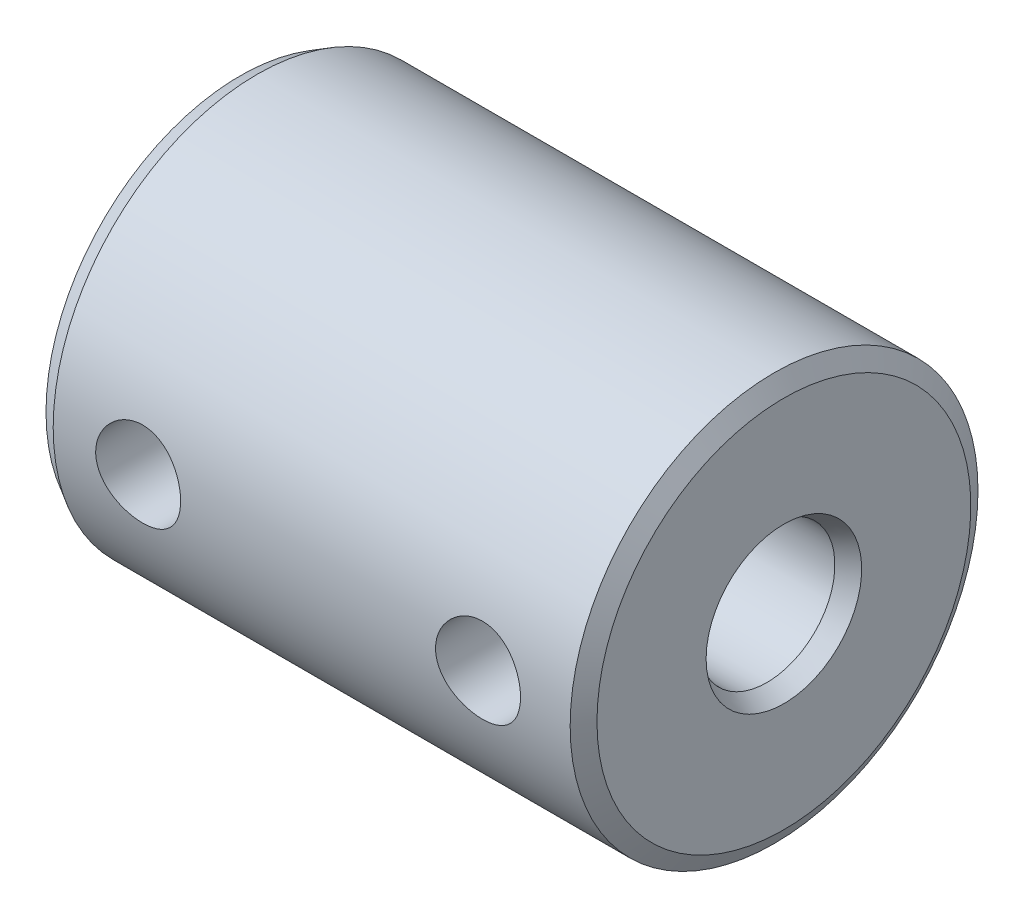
ISO-10303-21;
HEADER;
FILE_DESCRIPTION(('STEP AP214'),'2;1');
FILE_NAME('part.step','',(''),(''),'','','');
FILE_SCHEMA(('AUTOMOTIVE_DESIGN { 1 0 10303 214 1 1 1 1 }'));
ENDSEC;
DATA;
#1=APPLICATION_CONTEXT('core data for automotive mechanical design processes');
#2=APPLICATION_PROTOCOL_DEFINITION('international standard','automotive_design',2000,#1);
#3=PRODUCT_CONTEXT('',#1,'mechanical');
#4=PRODUCT('Part','Part','',(#3));
#5=PRODUCT_RELATED_PRODUCT_CATEGORY('part','',(#4));
#6=PRODUCT_DEFINITION_FORMATION('','',#4);
#7=PRODUCT_DEFINITION_CONTEXT('part definition',#1,'design');
#8=PRODUCT_DEFINITION('design','',#6,#7);
#9=PRODUCT_DEFINITION_SHAPE('','',#8);
#10=(LENGTH_UNIT() NAMED_UNIT(*) SI_UNIT(.MILLI.,.METRE.));
#11=(NAMED_UNIT(*) PLANE_ANGLE_UNIT() SI_UNIT($,.RADIAN.));
#12=(NAMED_UNIT(*) SI_UNIT($,.STERADIAN.) SOLID_ANGLE_UNIT());
#13=UNCERTAINTY_MEASURE_WITH_UNIT(LENGTH_MEASURE(1.E-05),#10,'distance_accuracy_value','');
#14=(GEOMETRIC_REPRESENTATION_CONTEXT(3) GLOBAL_UNCERTAINTY_ASSIGNED_CONTEXT((#13)) GLOBAL_UNIT_ASSIGNED_CONTEXT((#10,
#11,#12)) REPRESENTATION_CONTEXT('',''));
#15=CARTESIAN_POINT('',(0.,0.,0.));
#16=DIRECTION('',(0.,0.,1.));
#17=DIRECTION('',(1.,0.,0.));
#18=AXIS2_PLACEMENT_3D('',#15,#16,#17);
#19=CARTESIAN_POINT('',(0.,0.,0.));
#20=DIRECTION('',(-1.,0.,0.));
#21=DIRECTION('',(0.,0.,1.));
#22=AXIS2_PLACEMENT_3D('',#19,#20,#21);
#23=CYLINDRICAL_SURFACE('',#22,3.);
#24=CARTESIAN_POINT('',(4.24999999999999,0.,3.));
#25=CARTESIAN_POINT('',(4.2499927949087,0.0669580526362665,2.99999458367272));
#26=CARTESIAN_POINT('',(4.24458804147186,0.13402139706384,2.9977323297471));
#27=CARTESIAN_POINT('',(4.22316093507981,0.266247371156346,2.98890153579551));
#28=CARTESIAN_POINT('',(4.20711087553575,0.331404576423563,2.98232175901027));
#29=CARTESIAN_POINT('',(4.16508890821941,0.457688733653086,2.96556289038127));
#30=CARTESIAN_POINT('',(4.13915061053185,0.518828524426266,2.95539599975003));
#31=CARTESIAN_POINT('',(4.07822717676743,0.635829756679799,2.93245286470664));
#32=CARTESIAN_POINT('',(4.04324478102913,0.691692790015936,2.91967741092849));
#33=CARTESIAN_POINT('',(3.96337101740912,0.799448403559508,2.89207828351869));
#34=CARTESIAN_POINT('',(3.91809869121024,0.851041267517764,2.87718753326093));
#35=CARTESIAN_POINT('',(3.81973566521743,0.946159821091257,2.84732714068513));
#36=CARTESIAN_POINT('',(3.76664087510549,0.98968126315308,2.83235746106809));
#37=CARTESIAN_POINT('',(3.6509732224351,1.06953737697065,2.80321021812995));
#38=CARTESIAN_POINT('',(3.58806255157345,1.10541308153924,2.78910786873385));
#39=CARTESIAN_POINT('',(3.45642674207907,1.16593940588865,2.76435572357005));
#40=CARTESIAN_POINT('',(3.38770462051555,1.1905958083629,2.75370415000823));
#41=CARTESIAN_POINT('',(3.24984630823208,1.22674598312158,2.73778555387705));
#42=CARTESIAN_POINT('',(3.18088951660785,1.23881657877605,2.73228387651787));
#43=CARTESIAN_POINT('',(3.04172670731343,1.25125209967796,2.72661326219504));
#44=CARTESIAN_POINT('',(2.97152139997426,1.25162348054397,2.7264413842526));
#45=CARTESIAN_POINT('',(2.83759993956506,1.24108450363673,2.73125119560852));
#46=CARTESIAN_POINT('',(2.77379890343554,1.231036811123,2.73583882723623));
#47=CARTESIAN_POINT('',(2.64888790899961,1.20139191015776,2.74898482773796));
#48=CARTESIAN_POINT('',(2.58777846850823,1.18179287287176,2.75754395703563));
#49=CARTESIAN_POINT('',(2.46844229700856,1.1332195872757,2.77786184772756));
#50=CARTESIAN_POINT('',(2.41030457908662,1.10405471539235,2.78968481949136));
#51=CARTESIAN_POINT('',(2.29952226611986,1.03731242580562,2.81518331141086));
#52=CARTESIAN_POINT('',(2.24687984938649,0.999731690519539,2.82885956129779));
#53=CARTESIAN_POINT('',(2.14390004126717,0.913495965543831,2.85792976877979));
#54=CARTESIAN_POINT('',(2.09413343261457,0.864173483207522,2.87337121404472));
#55=CARTESIAN_POINT('',(2.00338649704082,0.757729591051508,2.90325673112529));
#56=CARTESIAN_POINT('',(1.96240822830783,0.700606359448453,2.9177005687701));
#57=CARTESIAN_POINT('',(1.88956417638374,0.578447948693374,2.94438283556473));
#58=CARTESIAN_POINT('',(1.85793055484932,0.513260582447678,2.95656266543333));
#59=CARTESIAN_POINT('',(1.80627886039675,0.37785240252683,2.97689481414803));
#60=CARTESIAN_POINT('',(1.78625436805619,0.307634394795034,2.985049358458));
#61=CARTESIAN_POINT('',(1.75958400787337,0.168928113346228,2.99599641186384));
#62=CARTESIAN_POINT('',(1.75217214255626,0.100611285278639,2.99909541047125));
#63=CARTESIAN_POINT('',(1.74865377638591,-0.0363546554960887,3.00056050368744));
#64=CARTESIAN_POINT('',(1.75254402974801,-0.105003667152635,2.99892795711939));
#65=CARTESIAN_POINT('',(1.77097108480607,-0.237098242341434,2.9913121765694));
#66=CARTESIAN_POINT('',(1.7849699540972,-0.300632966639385,2.98554887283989));
#67=CARTESIAN_POINT('',(1.82246819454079,-0.424382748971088,2.97048606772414));
#68=CARTESIAN_POINT('',(1.84596876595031,-0.484597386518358,2.96118611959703));
#69=CARTESIAN_POINT('',(1.90257097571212,-0.602108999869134,2.93958270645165));
#70=CARTESIAN_POINT('',(1.93594818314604,-0.659257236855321,2.92719491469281));
#71=CARTESIAN_POINT('',(2.0110533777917,-0.767346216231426,2.9007380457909));
#72=CARTESIAN_POINT('',(2.05278485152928,-0.818284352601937,2.88666826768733));
#73=CARTESIAN_POINT('',(2.14690323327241,-0.91633343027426,2.85712087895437));
#74=CARTESIAN_POINT('',(2.19983850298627,-0.962910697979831,2.84161451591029));
#75=CARTESIAN_POINT('',(2.3130212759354,-1.0466698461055,2.81184336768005));
#76=CARTESIAN_POINT('',(2.37327043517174,-1.08384959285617,2.79757886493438));
#77=CARTESIAN_POINT('',(2.50061417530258,-1.14815960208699,2.77181386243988));
#78=CARTESIAN_POINT('',(2.56779403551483,-1.17513918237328,2.76035562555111));
#79=CARTESIAN_POINT('',(2.70637059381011,-1.21717413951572,2.74208355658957));
#80=CARTESIAN_POINT('',(2.77776376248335,-1.23223934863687,2.73526589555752));
#81=CARTESIAN_POINT('',(2.91681869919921,-1.249040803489,2.72763164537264));
#82=CARTESIAN_POINT('',(2.98434466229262,-1.25171380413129,2.72639350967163));
#83=CARTESIAN_POINT('',(3.1188428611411,-1.24615575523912,2.72893853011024));
#84=CARTESIAN_POINT('',(3.18581518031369,-1.23792637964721,2.73272091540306));
#85=CARTESIAN_POINT('',(3.31409274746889,-1.21158404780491,2.74449551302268));
#86=CARTESIAN_POINT('',(3.37551667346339,-1.19394903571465,2.7522835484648));
#87=CARTESIAN_POINT('',(3.49454802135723,-1.14976328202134,2.77103181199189));
#88=CARTESIAN_POINT('',(3.55215436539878,-1.12321003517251,2.78199293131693));
#89=CARTESIAN_POINT('',(3.66569589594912,-1.06010285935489,2.80666954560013));
#90=CARTESIAN_POINT('',(3.72132233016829,-1.02304360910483,2.82051102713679));
#91=CARTESIAN_POINT('',(3.82586013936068,-0.940684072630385,2.84903689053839));
#92=CARTESIAN_POINT('',(3.87476917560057,-0.895380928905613,2.86372156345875));
#93=CARTESIAN_POINT('',(3.96814868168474,-0.793902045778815,2.89356392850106));
#94=CARTESIAN_POINT('',(4.01203643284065,-0.737174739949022,2.90867817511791));
#95=CARTESIAN_POINT('',(4.08969945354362,-0.616600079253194,2.9366014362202));
#96=CARTESIAN_POINT('',(4.12347011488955,-0.552749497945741,2.9494093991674));
#97=CARTESIAN_POINT('',(4.17920984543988,-0.420732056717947,2.9710918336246));
#98=CARTESIAN_POINT('',(4.20136476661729,-0.352653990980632,2.98002782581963));
#99=CARTESIAN_POINT('',(4.23370632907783,-0.213410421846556,2.99321009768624));
#100=CARTESIAN_POINT('',(4.24393044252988,-0.142255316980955,2.99747105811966));
#101=CARTESIAN_POINT('',(4.24933316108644,-0.047236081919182,2.99972287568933));
#102=CARTESIAN_POINT('',(4.25000254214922,-0.0236245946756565,3.00000191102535));
#103=CARTESIAN_POINT('',(4.24999999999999,0.,3.));
#104=B_SPLINE_CURVE_WITH_KNOTS('',3,(#24,#25,#26,#27,#28,#29,#30,#31,#32,#33,#34,#35,#36,#37,
#38,#39,#40,#41,#42,#43,#44,#45,#46,#47,#48,#49,#50,#51,#52,#53,#54,#55,#56,#57,#58,#59,#60,#61,
#62,#63,#64,#65,#66,#67,#68,#69,#70,#71,#72,#73,#74,#75,#76,#77,#78,#79,#80,#81,#82,#83,#84,#85,
#86,#87,#88,#89,#90,#91,#92,#93,#94,#95,#96,#97,#98,#99,#100,#101,#102,#103),.UNSPECIFIED.,.T.,
.F.,(4,2,2,2,2,2,2,2,2,2,2,2,2,2,2,2,2,2,2,2,2,2,2,2,2,2,2,2,2,2,2,2,2,2,2,2,2,2,2,4),(0.,
0.200806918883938,0.402138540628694,0.602791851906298,0.80338443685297,1.01317936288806,
1.22308438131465,1.44331724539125,1.66343646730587,1.87295273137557,2.08235338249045,
2.27570157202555,2.46908679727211,2.66658713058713,2.86416545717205,3.07844141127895,
3.29276749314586,3.51204055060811,3.73119224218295,3.93648443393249,4.1417176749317,
4.33676589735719,4.53183876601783,4.73297135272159,4.93418805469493,5.14978488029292,
5.36543061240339,5.58414788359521,5.80268447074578,6.00439877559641,6.20608211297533,
6.3983764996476,6.59072494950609,6.79463893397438,6.99862373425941,7.21746535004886,
7.43640649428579,7.65172855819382,7.86637250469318,7.93722256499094),.UNSPECIFIED.);
#105=CARTESIAN_POINT('',(4.24999999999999,0.,3.));
#106=VERTEX_POINT('',#105);
#107=EDGE_CURVE('E77',#106,#106,#104,.T.);
#108=ORIENTED_EDGE('',*,*,#107,.T.);
#109=EDGE_LOOP('',(#108));
#110=FACE_BOUND('',#109,.T.);
#111=CARTESIAN_POINT('',(0.288675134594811,0.,0.));
#112=DIRECTION('',(1.,0.,0.));
#113=DIRECTION('',(0.,0.,-1.));
#114=AXIS2_PLACEMENT_3D('',#111,#112,#113);
#115=CIRCLE('',#114,3.);
#116=CARTESIAN_POINT('',(0.288675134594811,0.,-3.));
#117=VERTEX_POINT('',#116);
#118=EDGE_CURVE('E109',#117,#117,#115,.F.);
#119=ORIENTED_EDGE('',*,*,#118,.T.);
#120=EDGE_LOOP('',(#119));
#121=FACE_BOUND('',#120,.T.);
#122=CARTESIAN_POINT('',(8.,0.,0.));
#123=DIRECTION('',(-1.,0.,0.));
#124=DIRECTION('',(0.,0.,1.));
#125=AXIS2_PLACEMENT_3D('',#122,#123,#124);
#126=CIRCLE('',#125,3.);
#127=CARTESIAN_POINT('',(8.,0.,3.));
#128=VERTEX_POINT('',#127);
#129=EDGE_CURVE('E76',#128,#128,#126,.T.);
#130=ORIENTED_EDGE('',*,*,#129,.F.);
#131=EDGE_LOOP('',(#130));
#132=FACE_BOUND('',#131,.T.);
#133=ADVANCED_FACE('F30',(#110,#121,#132),#23,.F.);
#134=CARTESIAN_POINT('',(0.,3.,0.));
#135=DIRECTION('',(1.,0.,0.));
#136=DIRECTION('',(0.,0.,-1.));
#137=AXIS2_PLACEMENT_3D('',#134,#135,#136);
#138=PLANE('',#137);
#139=CARTESIAN_POINT('',(0.,0.,0.));
#140=DIRECTION('',(1.,0.,0.));
#141=DIRECTION('',(0.,0.,-1.));
#142=AXIS2_PLACEMENT_3D('',#139,#140,#141);
#143=CIRCLE('',#142,3.5);
#144=CARTESIAN_POINT('',(0.,0.,-3.5));
#145=VERTEX_POINT('',#144);
#146=EDGE_CURVE('E123',#145,#145,#143,.T.);
#147=ORIENTED_EDGE('',*,*,#146,.T.);
#148=EDGE_LOOP('',(#147));
#149=FACE_BOUND('',#148,.T.);
#150=CARTESIAN_POINT('',(0.,0.,0.));
#151=DIRECTION('',(1.,0.,0.));
#152=DIRECTION('',(0.,0.,-1.));
#153=AXIS2_PLACEMENT_3D('',#150,#151,#152);
#154=CIRCLE('',#153,5.71132486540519);
#155=CARTESIAN_POINT('',(0.,0.,-5.71132486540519));
#156=VERTEX_POINT('',#155);
#157=EDGE_CURVE('E117',#156,#156,#154,.F.);
#158=ORIENTED_EDGE('',*,*,#157,.T.);
#159=EDGE_LOOP('',(#158));
#160=FACE_BOUND('',#159,.T.);
#161=ADVANCED_FACE('F94',(#149,#160),#138,.F.);
#162=CARTESIAN_POINT('',(0.,0.,0.));
#163=DIRECTION('',(-1.,0.,0.));
#164=DIRECTION('',(0.,0.,1.));
#165=AXIS2_PLACEMENT_3D('',#162,#163,#164);
#166=CYLINDRICAL_SURFACE('',#165,6.);
#167=CARTESIAN_POINT('',(1.75000000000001,0.,6.));
#168=CARTESIAN_POINT('',(1.75000247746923,0.0694090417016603,5.99999871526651));
#169=CARTESIAN_POINT('',(1.75580066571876,0.138848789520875,5.99878328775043));
#170=CARTESIAN_POINT('',(1.77881934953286,0.275761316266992,5.99405200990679));
#171=CARTESIAN_POINT('',(1.79604852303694,0.343232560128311,5.99053441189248));
#172=CARTESIAN_POINT('',(1.84137045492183,0.474209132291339,5.98159109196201));
#173=CARTESIAN_POINT('',(1.86945239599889,0.537718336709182,5.97616727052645));
#174=CARTESIAN_POINT('',(1.93564960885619,0.659120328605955,5.96399927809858));
#175=CARTESIAN_POINT('',(1.97376443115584,0.717013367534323,5.95725516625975));
#176=CARTESIAN_POINT('',(2.05953634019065,0.826390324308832,5.9430770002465));
#177=CARTESIAN_POINT('',(2.10731200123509,0.87778024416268,5.93563505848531));
#178=CARTESIAN_POINT('',(2.21079465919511,0.971877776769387,5.92095657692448));
#179=CARTESIAN_POINT('',(2.26650231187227,1.01458467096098,5.91372005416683));
#180=CARTESIAN_POINT('',(2.38495196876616,1.09051031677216,5.90019442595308));
#181=CARTESIAN_POINT('',(2.44775838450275,1.1236305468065,5.89391545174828));
#182=CARTESIAN_POINT('',(2.57819745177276,1.17881119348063,5.8831284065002));
#183=CARTESIAN_POINT('',(2.64582958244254,1.20087280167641,5.87862014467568));
#184=CARTESIAN_POINT('',(2.78298523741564,1.23300240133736,5.87196500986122));
#185=CARTESIAN_POINT('',(2.85246835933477,1.24323597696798,5.86978556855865));
#186=CARTESIAN_POINT('',(2.99219684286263,1.25193357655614,5.86793690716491));
#187=CARTESIAN_POINT('',(3.0624421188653,1.25039890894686,5.86826740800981));
#188=CARTESIAN_POINT('',(3.20048102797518,1.23573719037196,5.87137174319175));
#189=CARTESIAN_POINT('',(3.26829597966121,1.2228010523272,5.87410533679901));
#190=CARTESIAN_POINT('',(3.40077150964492,1.18600543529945,5.88164437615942));
#191=CARTESIAN_POINT('',(3.46543192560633,1.16214539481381,5.88644992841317));
#192=CARTESIAN_POINT('',(3.59030722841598,1.10400003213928,5.89763191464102));
#193=CARTESIAN_POINT('',(3.65048629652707,1.06964002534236,5.90401953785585));
#194=CARTESIAN_POINT('',(3.76429574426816,0.991522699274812,5.91763890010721));
#195=CARTESIAN_POINT('',(3.81792530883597,0.947764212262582,5.92487074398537));
#196=CARTESIAN_POINT('',(3.91821396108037,0.851074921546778,5.93953730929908));
#197=CARTESIAN_POINT('',(3.96471616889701,0.797981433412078,5.94697323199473));
#198=CARTESIAN_POINT('',(4.04818044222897,0.684667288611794,5.96108088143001));
#199=CARTESIAN_POINT('',(4.08514236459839,0.624446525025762,5.96775259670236));
#200=CARTESIAN_POINT('',(4.14851008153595,0.498405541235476,5.97959870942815));
#201=CARTESIAN_POINT('',(4.17489680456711,0.432575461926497,5.98477039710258));
#202=CARTESIAN_POINT('',(4.21619170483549,0.297284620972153,5.99301338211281));
#203=CARTESIAN_POINT('',(4.23110139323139,0.227824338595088,5.99608495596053));
#204=CARTESIAN_POINT('',(4.24879425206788,0.0885918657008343,5.99974275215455));
#205=CARTESIAN_POINT('',(4.25179194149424,0.0188480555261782,6.00037293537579));
#206=CARTESIAN_POINT('',(4.24615505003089,-0.120143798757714,5.99919952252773));
#207=CARTESIAN_POINT('',(4.2375211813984,-0.189391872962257,5.99739607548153));
#208=CARTESIAN_POINT('',(4.20904434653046,-0.324726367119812,5.99158564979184));
#209=CARTESIAN_POINT('',(4.18931251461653,-0.390837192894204,5.98760052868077));
#210=CARTESIAN_POINT('',(4.13932213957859,-0.518811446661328,5.97787227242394));
#211=CARTESIAN_POINT('',(4.10906275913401,-0.580674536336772,5.97212899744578));
#212=CARTESIAN_POINT('',(4.03841962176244,-0.69929430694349,5.95941241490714));
#213=CARTESIAN_POINT('',(3.99790807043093,-0.75597321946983,5.9524239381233));
#214=CARTESIAN_POINT('',(3.90808043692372,-0.861805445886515,5.93802568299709));
#215=CARTESIAN_POINT('',(3.85876332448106,-0.910957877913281,5.93061585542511));
#216=CARTESIAN_POINT('',(3.7517444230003,-1.0011786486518,5.91606024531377));
#217=CARTESIAN_POINT('',(3.69391696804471,-1.04209914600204,5.90892089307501));
#218=CARTESIAN_POINT('',(3.57208371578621,-1.11364719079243,5.89585601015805));
#219=CARTESIAN_POINT('',(3.50807817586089,-1.14427516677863,5.88993042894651));
#220=CARTESIAN_POINT('',(3.37603880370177,-1.19417246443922,5.88001700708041));
#221=CARTESIAN_POINT('',(3.30802896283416,-1.21350309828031,5.87601872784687));
#222=CARTESIAN_POINT('',(3.16963344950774,-1.24044038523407,5.87039184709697));
#223=CARTESIAN_POINT('',(3.09924811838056,-1.2480487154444,5.86876290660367));
#224=CARTESIAN_POINT('',(2.95958659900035,-1.25125926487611,5.86807907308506));
#225=CARTESIAN_POINT('',(2.89031592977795,-1.24709542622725,5.86897402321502));
#226=CARTESIAN_POINT('',(2.75348599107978,-1.22739905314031,5.87312447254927));
#227=CARTESIAN_POINT('',(2.6859267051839,-1.21186662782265,5.87637994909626));
#228=CARTESIAN_POINT('',(2.55460222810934,-1.16998217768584,5.88486132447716));
#229=CARTESIAN_POINT('',(2.49082675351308,-1.14366117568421,5.8900815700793));
#230=CARTESIAN_POINT('',(2.36856122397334,-1.08097457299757,5.90190705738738));
#231=CARTESIAN_POINT('',(2.31007166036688,-1.04460803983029,5.9085124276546));
#232=CARTESIAN_POINT('',(2.19887837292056,-0.962073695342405,5.92251579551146));
#233=CARTESIAN_POINT('',(2.14630087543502,-0.91573789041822,5.92992613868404));
#234=CARTESIAN_POINT('',(2.04959050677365,-0.814924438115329,5.94461839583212));
#235=CARTESIAN_POINT('',(2.00545958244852,-0.760444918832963,5.95190027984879));
#236=CARTESIAN_POINT('',(1.92641142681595,-0.644134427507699,5.96561444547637));
#237=CARTESIAN_POINT('',(1.89160632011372,-0.582225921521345,5.97203596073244));
#238=CARTESIAN_POINT('',(1.83294977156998,-0.453319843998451,5.98319908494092));
#239=CARTESIAN_POINT('',(1.80908875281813,-0.386326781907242,5.98794216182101));
#240=CARTESIAN_POINT('',(1.77745972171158,-0.266015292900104,5.99432499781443));
#241=CARTESIAN_POINT('',(1.76718123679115,-0.213367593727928,5.99644035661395));
#242=CARTESIAN_POINT('',(1.75345054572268,-0.107152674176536,5.99927832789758));
#243=CARTESIAN_POINT('',(1.74999808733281,-0.0535854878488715,6.00000099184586));
#244=CARTESIAN_POINT('',(1.75000000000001,0.,6.));
#245=B_SPLINE_CURVE_WITH_KNOTS('',3,(#167,#168,#169,#170,#171,#172,#173,#174,#175,#176,#177,
#178,#179,#180,#181,#182,#183,#184,#185,#186,#187,#188,#189,#190,#191,#192,#193,#194,#195,#196,
#197,#198,#199,#200,#201,#202,#203,#204,#205,#206,#207,#208,#209,#210,#211,#212,#213,#214,#215,
#216,#217,#218,#219,#220,#221,#222,#223,#224,#225,#226,#227,#228,#229,#230,#231,#232,#233,#234,
#235,#236,#237,#238,#239,#240,#241,#242,#243,#244),.UNSPECIFIED.,.T.,.F.,(4,2,2,2,2,2,2,2,2,2,2,
2,2,2,2,2,2,2,2,2,2,2,2,2,2,2,2,2,2,2,2,2,2,2,2,2,2,2,4),(0.,0.208031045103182,
0.416220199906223,0.624202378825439,0.832175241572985,1.04287526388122,1.25359271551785,
1.46640449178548,1.67919333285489,1.88896575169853,2.09871484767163,2.30501712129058,
2.51133000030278,2.71914592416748,2.92698768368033,3.13889526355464,3.35080602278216,
3.56309724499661,3.77536051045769,3.98378339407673,4.19219351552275,4.39855286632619,
4.60492863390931,4.81401583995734,5.02312752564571,5.23571263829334,5.44828889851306,
5.65970050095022,5.87108185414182,6.07829223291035,6.28550062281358,6.49211731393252,
6.69875319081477,6.90919024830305,7.11967575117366,7.33258864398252,7.54531486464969,
7.70592588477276,7.86653096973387),.UNSPECIFIED.);
#246=CARTESIAN_POINT('',(1.75000000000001,0.,6.));
#247=VERTEX_POINT('',#246);
#248=EDGE_CURVE('E10',#247,#247,#245,.T.);
#249=ORIENTED_EDGE('',*,*,#248,.T.);
#250=EDGE_LOOP('',(#249));
#251=FACE_BOUND('',#250,.T.);
#252=CARTESIAN_POINT('',(11.75,0.,6.));
#253=CARTESIAN_POINT('',(11.7500024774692,0.0694090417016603,5.99999871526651));
#254=CARTESIAN_POINT('',(11.7558006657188,0.138848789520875,5.99878328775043));
#255=CARTESIAN_POINT('',(11.7788193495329,0.275761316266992,5.99405200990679));
#256=CARTESIAN_POINT('',(11.7960485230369,0.343232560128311,5.99053441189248));
#257=CARTESIAN_POINT('',(11.8413704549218,0.474209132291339,5.98159109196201));
#258=CARTESIAN_POINT('',(11.8694523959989,0.537718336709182,5.97616727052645));
#259=CARTESIAN_POINT('',(11.9356496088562,0.659120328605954,5.96399927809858));
#260=CARTESIAN_POINT('',(11.9737644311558,0.717013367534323,5.95725516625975));
#261=CARTESIAN_POINT('',(12.0595363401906,0.826390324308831,5.9430770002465));
#262=CARTESIAN_POINT('',(12.1073120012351,0.877780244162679,5.93563505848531));
#263=CARTESIAN_POINT('',(12.2107946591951,0.971877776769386,5.92095657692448));
#264=CARTESIAN_POINT('',(12.2665023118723,1.01458467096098,5.91372005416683));
#265=CARTESIAN_POINT('',(12.3849519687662,1.09051031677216,5.90019442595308));
#266=CARTESIAN_POINT('',(12.4477583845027,1.1236305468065,5.89391545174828));
#267=CARTESIAN_POINT('',(12.5781974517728,1.17881119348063,5.8831284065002));
#268=CARTESIAN_POINT('',(12.6458295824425,1.20087280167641,5.87862014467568));
#269=CARTESIAN_POINT('',(12.7829852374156,1.23300240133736,5.87196500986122));
#270=CARTESIAN_POINT('',(12.8524683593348,1.24323597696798,5.86978556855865));
#271=CARTESIAN_POINT('',(12.9921968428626,1.25193357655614,5.86793690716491));
#272=CARTESIAN_POINT('',(13.0624421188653,1.25039890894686,5.86826740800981));
#273=CARTESIAN_POINT('',(13.2004810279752,1.23573719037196,5.87137174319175));
#274=CARTESIAN_POINT('',(13.2682959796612,1.2228010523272,5.87410533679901));
#275=CARTESIAN_POINT('',(13.4007715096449,1.18600543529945,5.88164437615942));
#276=CARTESIAN_POINT('',(13.4654319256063,1.16214539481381,5.88644992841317));
#277=CARTESIAN_POINT('',(13.590307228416,1.10400003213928,5.89763191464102));
#278=CARTESIAN_POINT('',(13.6504862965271,1.06964002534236,5.90401953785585));
#279=CARTESIAN_POINT('',(13.7642957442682,0.991522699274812,5.91763890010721));
#280=CARTESIAN_POINT('',(13.817925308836,0.947764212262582,5.92487074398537));
#281=CARTESIAN_POINT('',(13.9182139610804,0.851074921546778,5.93953730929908));
#282=CARTESIAN_POINT('',(13.964716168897,0.797981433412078,5.94697323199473));
#283=CARTESIAN_POINT('',(14.048180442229,0.684667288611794,5.96108088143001));
#284=CARTESIAN_POINT('',(14.0851423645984,0.624446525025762,5.96775259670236));
#285=CARTESIAN_POINT('',(14.1485100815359,0.498405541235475,5.97959870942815));
#286=CARTESIAN_POINT('',(14.1748968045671,0.432575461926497,5.98477039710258));
#287=CARTESIAN_POINT('',(14.2161917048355,0.297284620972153,5.9930133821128));
#288=CARTESIAN_POINT('',(14.2311013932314,0.227824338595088,5.99608495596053));
#289=CARTESIAN_POINT('',(14.2487942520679,0.0885918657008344,5.99974275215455));
#290=CARTESIAN_POINT('',(14.2517919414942,0.0188480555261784,6.00037293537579));
#291=CARTESIAN_POINT('',(14.2461550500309,-0.120143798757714,5.99919952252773));
#292=CARTESIAN_POINT('',(14.2375211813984,-0.189391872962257,5.99739607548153));
#293=CARTESIAN_POINT('',(14.2090443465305,-0.324726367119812,5.99158564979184));
#294=CARTESIAN_POINT('',(14.1893125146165,-0.390837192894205,5.98760052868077));
#295=CARTESIAN_POINT('',(14.1393221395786,-0.518811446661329,5.97787227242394));
#296=CARTESIAN_POINT('',(14.109062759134,-0.580674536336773,5.97212899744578));
#297=CARTESIAN_POINT('',(14.0384196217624,-0.69929430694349,5.95941241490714));
#298=CARTESIAN_POINT('',(13.9979080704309,-0.755973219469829,5.9524239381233));
#299=CARTESIAN_POINT('',(13.9080804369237,-0.861805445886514,5.93802568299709));
#300=CARTESIAN_POINT('',(13.8587633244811,-0.910957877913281,5.93061585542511));
#301=CARTESIAN_POINT('',(13.7517444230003,-1.0011786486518,5.91606024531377));
#302=CARTESIAN_POINT('',(13.6939169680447,-1.04209914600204,5.90892089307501));
#303=CARTESIAN_POINT('',(13.5720837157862,-1.11364719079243,5.89585601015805));
#304=CARTESIAN_POINT('',(13.5080781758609,-1.14427516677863,5.88993042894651));
#305=CARTESIAN_POINT('',(13.3760388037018,-1.19417246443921,5.88001700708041));
#306=CARTESIAN_POINT('',(13.3080289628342,-1.21350309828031,5.87601872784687));
#307=CARTESIAN_POINT('',(13.1696334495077,-1.24044038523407,5.87039184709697));
#308=CARTESIAN_POINT('',(13.0992481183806,-1.2480487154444,5.86876290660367));
#309=CARTESIAN_POINT('',(12.9595865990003,-1.25125926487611,5.86807907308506));
#310=CARTESIAN_POINT('',(12.8903159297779,-1.24709542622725,5.86897402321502));
#311=CARTESIAN_POINT('',(12.7534859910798,-1.22739905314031,5.87312447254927));
#312=CARTESIAN_POINT('',(12.6859267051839,-1.21186662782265,5.87637994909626));
#313=CARTESIAN_POINT('',(12.5546022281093,-1.16998217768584,5.88486132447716));
#314=CARTESIAN_POINT('',(12.4908267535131,-1.14366117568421,5.8900815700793));
#315=CARTESIAN_POINT('',(12.3685612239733,-1.08097457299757,5.90190705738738));
#316=CARTESIAN_POINT('',(12.3100716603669,-1.04460803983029,5.9085124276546));
#317=CARTESIAN_POINT('',(12.1988783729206,-0.962073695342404,5.92251579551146));
#318=CARTESIAN_POINT('',(12.146300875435,-0.91573789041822,5.92992613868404));
#319=CARTESIAN_POINT('',(12.0495905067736,-0.814924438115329,5.94461839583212));
#320=CARTESIAN_POINT('',(12.0054595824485,-0.760444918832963,5.95190027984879));
#321=CARTESIAN_POINT('',(11.9264114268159,-0.644134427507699,5.96561444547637));
#322=CARTESIAN_POINT('',(11.8916063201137,-0.582225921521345,5.97203596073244));
#323=CARTESIAN_POINT('',(11.83294977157,-0.453319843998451,5.98319908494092));
#324=CARTESIAN_POINT('',(11.8090887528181,-0.386326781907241,5.98794216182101));
#325=CARTESIAN_POINT('',(11.7774597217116,-0.266015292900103,5.99432499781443));
#326=CARTESIAN_POINT('',(11.7671812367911,-0.213367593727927,5.99644035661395));
#327=CARTESIAN_POINT('',(11.7534505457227,-0.107152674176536,5.99927832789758));
#328=CARTESIAN_POINT('',(11.7499980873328,-0.0535854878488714,6.00000099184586));
#329=CARTESIAN_POINT('',(11.75,0.,6.));
#330=B_SPLINE_CURVE_WITH_KNOTS('',3,(#252,#253,#254,#255,#256,#257,#258,#259,#260,#261,#262,
#263,#264,#265,#266,#267,#268,#269,#270,#271,#272,#273,#274,#275,#276,#277,#278,#279,#280,#281,
#282,#283,#284,#285,#286,#287,#288,#289,#290,#291,#292,#293,#294,#295,#296,#297,#298,#299,#300,
#301,#302,#303,#304,#305,#306,#307,#308,#309,#310,#311,#312,#313,#314,#315,#316,#317,#318,#319,
#320,#321,#322,#323,#324,#325,#326,#327,#328,#329),.UNSPECIFIED.,.T.,.F.,(4,2,2,2,2,2,2,2,2,2,2,
2,2,2,2,2,2,2,2,2,2,2,2,2,2,2,2,2,2,2,2,2,2,2,2,2,2,2,4),(0.,0.208031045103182,
0.416220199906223,0.624202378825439,0.832175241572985,1.04287526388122,1.25359271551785,
1.46640449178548,1.67919333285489,1.88896575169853,2.09871484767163,2.30501712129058,
2.51133000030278,2.71914592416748,2.92698768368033,3.13889526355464,3.35080602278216,
3.5630972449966,3.77536051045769,3.98378339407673,4.19219351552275,4.39855286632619,
4.60492863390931,4.81401583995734,5.02312752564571,5.23571263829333,5.44828889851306,
5.65970050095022,5.87108185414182,6.07829223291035,6.28550062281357,6.49211731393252,
6.69875319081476,6.90919024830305,7.11967575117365,7.33258864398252,7.54531486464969,
7.70592588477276,7.86653096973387),.UNSPECIFIED.);
#331=CARTESIAN_POINT('',(11.75,0.,6.));
#332=VERTEX_POINT('',#331);
#333=EDGE_CURVE('E41',#332,#332,#330,.T.);
#334=ORIENTED_EDGE('',*,*,#333,.T.);
#335=EDGE_LOOP('',(#334));
#336=FACE_BOUND('',#335,.T.);
#337=CARTESIAN_POINT('',(0.500000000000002,0.,0.));
#338=DIRECTION('',(1.,0.,0.));
#339=DIRECTION('',(0.,0.,-1.));
#340=AXIS2_PLACEMENT_3D('',#337,#338,#339);
#341=CIRCLE('',#340,6.);
#342=CARTESIAN_POINT('',(0.500000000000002,0.,-6.));
#343=VERTEX_POINT('',#342);
#344=EDGE_CURVE('E129',#343,#343,#341,.T.);
#345=ORIENTED_EDGE('',*,*,#344,.T.);
#346=EDGE_LOOP('',(#345));
#347=FACE_BOUND('',#346,.T.);
#348=CARTESIAN_POINT('',(15.7113248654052,0.,0.));
#349=DIRECTION('',(-1.,0.,0.));
#350=DIRECTION('',(0.,0.,1.));
#351=AXIS2_PLACEMENT_3D('',#348,#349,#350);
#352=CIRCLE('',#351,6.);
#353=CARTESIAN_POINT('',(15.7113248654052,0.,6.));
#354=VERTEX_POINT('',#353);
#355=EDGE_CURVE('E126',#354,#354,#352,.T.);
#356=ORIENTED_EDGE('',*,*,#355,.T.);
#357=EDGE_LOOP('',(#356));
#358=FACE_BOUND('',#357,.T.);
#359=ADVANCED_FACE('F55',(#251,#336,#347,#358),#166,.T.);
#360=CARTESIAN_POINT('',(16.,6.,0.));
#361=DIRECTION('',(-1.,0.,0.));
#362=DIRECTION('',(0.,0.,1.));
#363=AXIS2_PLACEMENT_3D('',#360,#361,#362);
#364=PLANE('',#363);
#365=CARTESIAN_POINT('',(16.,0.,0.));
#366=DIRECTION('',(-1.,0.,0.));
#367=DIRECTION('',(0.,0.,1.));
#368=AXIS2_PLACEMENT_3D('',#365,#366,#367);
#369=CIRCLE('',#368,5.5);
#370=CARTESIAN_POINT('',(16.,0.,5.5));
#371=VERTEX_POINT('',#370);
#372=EDGE_CURVE('E49',#371,#371,#369,.F.);
#373=ORIENTED_EDGE('',*,*,#372,.T.);
#374=EDGE_LOOP('',(#373));
#375=FACE_BOUND('',#374,.T.);
#376=CARTESIAN_POINT('',(16.,0.,0.));
#377=DIRECTION('',(-1.,0.,0.));
#378=DIRECTION('',(0.,0.,1.));
#379=AXIS2_PLACEMENT_3D('',#376,#377,#378);
#380=CIRCLE('',#379,2.28867513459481);
#381=CARTESIAN_POINT('',(16.,0.,2.28867513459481));
#382=VERTEX_POINT('',#381);
#383=EDGE_CURVE('E132',#382,#382,#380,.T.);
#384=ORIENTED_EDGE('',*,*,#383,.T.);
#385=EDGE_LOOP('',(#384));
#386=FACE_BOUND('',#385,.T.);
#387=ADVANCED_FACE('F86',(#375,#386),#364,.F.);
#388=CARTESIAN_POINT('',(0.,0.,0.));
#389=DIRECTION('',(-1.,0.,0.));
#390=DIRECTION('',(0.,0.,1.));
#391=AXIS2_PLACEMENT_3D('',#388,#389,#390);
#392=CYLINDRICAL_SURFACE('',#391,1.99999999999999);
#393=CARTESIAN_POINT('',(14.25,0.,1.99999999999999));
#394=CARTESIAN_POINT('',(14.2499956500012,0.0635104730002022,1.99999595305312));
#395=CARTESIAN_POINT('',(14.2451269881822,0.127096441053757,1.99694323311));
#396=CARTESIAN_POINT('',(14.2259141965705,0.252318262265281,1.98502167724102));
#397=CARTESIAN_POINT('',(14.2115520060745,0.313950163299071,1.97614175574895));
#398=CARTESIAN_POINT('',(14.1741886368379,0.43320555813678,1.95345852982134));
#399=CARTESIAN_POINT('',(14.1512302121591,0.490847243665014,1.93967960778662));
#400=CARTESIAN_POINT('',(14.0976141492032,0.601260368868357,1.90834598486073));
#401=CARTESIAN_POINT('',(14.0669573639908,0.654032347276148,1.89079170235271));
#402=CARTESIAN_POINT('',(13.996113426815,0.757974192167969,1.85170152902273));
#403=CARTESIAN_POINT('',(13.9553607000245,0.808679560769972,1.82995962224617));
#404=CARTESIAN_POINT('',(13.8667808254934,0.902986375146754,1.78531349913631));
#405=CARTESIAN_POINT('',(13.8189441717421,0.946578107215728,1.76240774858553));
#406=CARTESIAN_POINT('',(13.7099661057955,1.03142873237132,1.71430418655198));
#407=CARTESIAN_POINT('',(13.6479002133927,1.0715720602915,1.68921610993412));
#408=CARTESIAN_POINT('',(13.5164351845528,1.14073966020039,1.64330198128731));
#409=CARTESIAN_POINT('',(13.4470486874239,1.16978270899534,1.62246875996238));
#410=CARTESIAN_POINT('',(13.3211894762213,1.2093340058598,1.59309575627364));
#411=CARTESIAN_POINT('',(13.2660331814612,1.22269552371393,1.58276905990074));
#412=CARTESIAN_POINT('',(13.1536940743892,1.24181843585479,1.56781357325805));
#413=CARTESIAN_POINT('',(13.0965142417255,1.24759056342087,1.56317673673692));
#414=CARTESIAN_POINT('',(12.9815869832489,1.25118918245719,1.56029885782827));
#415=CARTESIAN_POINT('',(12.9238384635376,1.2489948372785,1.56207458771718));
#416=CARTESIAN_POINT('',(12.809689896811,1.23676317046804,1.5717740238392));
#417=CARTESIAN_POINT('',(12.7532909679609,1.22671956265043,1.5797026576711));
#418=CARTESIAN_POINT('',(12.6445615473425,1.19968103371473,1.60032573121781));
#419=CARTESIAN_POINT('',(12.5921675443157,1.18285016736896,1.61290715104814));
#420=CARTESIAN_POINT('',(12.4908388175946,1.14290189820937,1.64145566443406));
#421=CARTESIAN_POINT('',(12.4419053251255,1.11978227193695,1.65742395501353));
#422=CARTESIAN_POINT('',(12.3391667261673,1.06294892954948,1.69454815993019));
#423=CARTESIAN_POINT('',(12.2861591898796,1.0280629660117,1.71611591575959));
#424=CARTESIAN_POINT('',(12.1861697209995,0.950881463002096,1.76005711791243));
#425=CARTESIAN_POINT('',(12.1391940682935,0.908578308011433,1.78243137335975));
#426=CARTESIAN_POINT('',(12.0446982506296,0.809519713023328,1.82979894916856));
#427=CARTESIAN_POINT('',(11.9983670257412,0.751531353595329,1.85461531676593));
#428=CARTESIAN_POINT('',(11.9161491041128,0.627148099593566,1.90028055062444));
#429=CARTESIAN_POINT('',(11.8802583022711,0.560756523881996,1.92113097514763));
#430=CARTESIAN_POINT('',(11.8222363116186,0.424883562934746,1.95553372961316));
#431=CARTESIAN_POINT('',(11.7994659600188,0.355763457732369,1.96941976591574));
#432=CARTESIAN_POINT('',(11.7662350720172,0.213612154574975,1.98984929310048));
#433=CARTESIAN_POINT('',(11.755757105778,0.140586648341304,1.99640317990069));
#434=CARTESIAN_POINT('',(11.7484341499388,0.004515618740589,2.00097840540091));
#435=CARTESIAN_POINT('',(11.7497968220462,-0.0584027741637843,2.0001216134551));
#436=CARTESIAN_POINT('',(11.7618828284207,-0.182972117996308,1.99258901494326));
#437=CARTESIAN_POINT('',(11.7726055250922,-0.244623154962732,1.98591360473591));
#438=CARTESIAN_POINT('',(11.802238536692,-0.362521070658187,1.96774052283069));
#439=CARTESIAN_POINT('',(11.8208121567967,-0.418885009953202,1.95644170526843));
#440=CARTESIAN_POINT('',(11.8652963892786,-0.527638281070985,1.92995684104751));
#441=CARTESIAN_POINT('',(11.8912082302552,-0.580026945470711,1.91477014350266));
#442=CARTESIAN_POINT('',(11.9525152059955,-0.685084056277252,1.87990012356));
#443=CARTESIAN_POINT('',(11.9886035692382,-0.737246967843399,1.85991764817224));
#444=CARTESIAN_POINT('',(12.0677938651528,-0.835142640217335,1.81806970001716));
#445=CARTESIAN_POINT('',(12.1109035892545,-0.880868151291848,1.79620214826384));
#446=CARTESIAN_POINT('',(12.2101350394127,-0.971474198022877,1.74905869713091));
#447=CARTESIAN_POINT('',(12.2672372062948,-1.01526851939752,1.72374883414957));
#448=CARTESIAN_POINT('',(12.3888757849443,-1.09280351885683,1.67566762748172));
#449=CARTESIAN_POINT('',(12.453407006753,-1.12655115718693,1.65289453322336));
#450=CARTESIAN_POINT('',(12.5746921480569,-1.17684772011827,1.61733530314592));
#451=CARTESIAN_POINT('',(12.6302407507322,-1.19551895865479,1.6034563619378));
#452=CARTESIAN_POINT('',(12.7443931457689,-1.22500108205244,1.58105030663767));
#453=CARTESIAN_POINT('',(12.8029920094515,-1.23582424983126,1.57251483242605));
#454=CARTESIAN_POINT('',(12.9220902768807,-1.24901383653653,1.56206324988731));
#455=CARTESIAN_POINT('',(12.9825985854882,-1.25133186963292,1.56018501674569));
#456=CARTESIAN_POINT('',(13.103130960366,-1.24719778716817,1.56349063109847));
#457=CARTESIAN_POINT('',(13.1631548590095,-1.24074275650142,1.56867682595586));
#458=CARTESIAN_POINT('',(13.2760297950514,-1.22038272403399,1.58455388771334));
#459=CARTESIAN_POINT('',(13.3290693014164,-1.20711919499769,1.5947680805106));
#460=CARTESIAN_POINT('',(13.4321350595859,-1.17417623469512,1.6191753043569));
#461=CARTESIAN_POINT('',(13.4821600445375,-1.15449412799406,1.63336999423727));
#462=CARTESIAN_POINT('',(13.5855967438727,-1.10602690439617,1.66663902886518));
#463=CARTESIAN_POINT('',(13.6384502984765,-1.07633644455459,1.68612230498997));
#464=CARTESIAN_POINT('',(13.738938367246,-1.01000017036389,1.72667706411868));
#465=CARTESIAN_POINT('',(13.7865686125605,-0.973348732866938,1.74774982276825));
#466=CARTESIAN_POINT('',(13.8850142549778,-0.885670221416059,1.79401910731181));
#467=CARTESIAN_POINT('',(13.9345908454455,-0.833233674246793,1.81920541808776));
#468=CARTESIAN_POINT('',(14.0244948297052,-0.719822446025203,1.86698729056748));
#469=CARTESIAN_POINT('',(14.0648164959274,-0.658842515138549,1.88958124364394));
#470=CARTESIAN_POINT('',(14.1347711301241,-0.529355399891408,1.92986710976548));
#471=CARTESIAN_POINT('',(14.1643860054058,-0.460835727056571,1.94755071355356));
#472=CARTESIAN_POINT('',(14.2110718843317,-0.3183947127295,1.97581521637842));
#473=CARTESIAN_POINT('',(14.2281872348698,-0.244493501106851,1.98642121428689));
#474=CARTESIAN_POINT('',(14.2422992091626,-0.141418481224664,1.99519472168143));
#475=CARTESIAN_POINT('',(14.245181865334,-0.11324860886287,1.99699172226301));
#476=CARTESIAN_POINT('',(14.2490332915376,-0.05672418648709,1.99939530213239));
#477=CARTESIAN_POINT('',(14.25000194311,-0.0283696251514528,2.0000018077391));
#478=CARTESIAN_POINT('',(14.25,0.,1.99999999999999));
#479=B_SPLINE_CURVE_WITH_KNOTS('',3,(#393,#394,#395,#396,#397,#398,#399,#400,#401,#402,#403,
#404,#405,#406,#407,#408,#409,#410,#411,#412,#413,#414,#415,#416,#417,#418,#419,#420,#421,#422,
#423,#424,#425,#426,#427,#428,#429,#430,#431,#432,#433,#434,#435,#436,#437,#438,#439,#440,#441,
#442,#443,#444,#445,#446,#447,#448,#449,#450,#451,#452,#453,#454,#455,#456,#457,#458,#459,#460,
#461,#462,#463,#464,#465,#466,#467,#468,#469,#470,#471,#472,#473,#474,#475,#476,#477,#478),
.UNSPECIFIED.,.T.,.F.,(4,2,2,2,2,2,2,2,2,2,2,2,2,2,2,2,2,2,2,2,2,2,2,2,2,2,2,2,2,2,2,2,2,2,2,2,
2,2,2,2,2,2,4),(0.,0.190412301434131,0.381187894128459,0.571026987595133,0.760845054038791,
0.965821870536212,1.17107628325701,1.40412975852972,1.63678724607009,1.80912008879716,
1.98120894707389,2.15374823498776,2.32642584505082,2.49515839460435,2.66395067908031,
2.86427450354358,3.0648052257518,3.2984218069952,3.53194640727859,3.75284174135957,
3.97342347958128,4.1612718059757,4.34910733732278,4.52959504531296,4.71011298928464,
4.90885230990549,5.10781368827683,5.3356570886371,5.56334227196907,5.74329940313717,
5.92297427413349,6.10366974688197,6.2844252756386,6.45063169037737,6.61690747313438,
6.80725523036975,6.99775741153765,7.22600539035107,7.45439424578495,7.68316725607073,
7.91112460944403,7.99617501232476,8.08123067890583),.UNSPECIFIED.);
#480=CARTESIAN_POINT('',(14.25,0.,1.99999999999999));
#481=VERTEX_POINT('',#480);
#482=EDGE_CURVE('E69',#481,#481,#479,.T.);
#483=ORIENTED_EDGE('',*,*,#482,.T.);
#484=EDGE_LOOP('',(#483));
#485=FACE_BOUND('',#484,.T.);
#486=CARTESIAN_POINT('',(15.5,0.,0.));
#487=DIRECTION('',(-1.,0.,0.));
#488=DIRECTION('',(0.,0.,1.));
#489=AXIS2_PLACEMENT_3D('',#486,#487,#488);
#490=CIRCLE('',#489,1.99999999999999);
#491=CARTESIAN_POINT('',(15.5,0.,1.99999999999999));
#492=VERTEX_POINT('',#491);
#493=EDGE_CURVE('E45',#492,#492,#490,.F.);
#494=ORIENTED_EDGE('',*,*,#493,.T.);
#495=EDGE_LOOP('',(#494));
#496=FACE_BOUND('',#495,.T.);
#497=CARTESIAN_POINT('',(8.,0.,0.));
#498=DIRECTION('',(-1.,0.,0.));
#499=DIRECTION('',(0.,0.,1.));
#500=AXIS2_PLACEMENT_3D('',#497,#498,#499);
#501=CIRCLE('',#500,1.99999999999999);
#502=CARTESIAN_POINT('',(8.,0.,1.99999999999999));
#503=VERTEX_POINT('',#502);
#504=EDGE_CURVE('E113',#503,#503,#501,.T.);
#505=ORIENTED_EDGE('',*,*,#504,.T.);
#506=EDGE_LOOP('',(#505));
#507=FACE_BOUND('',#506,.T.);
#508=ADVANCED_FACE('F81',(#485,#496,#507),#392,.F.);
#509=CARTESIAN_POINT('',(8.,1.99999999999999,0.));
#510=DIRECTION('',(1.,0.,0.));
#511=DIRECTION('',(0.,0.,-1.));
#512=AXIS2_PLACEMENT_3D('',#509,#510,#511);
#513=PLANE('',#512);
#514=ORIENTED_EDGE('',*,*,#504,.F.);
#515=EDGE_LOOP('',(#514));
#516=FACE_BOUND('',#515,.T.);
#517=ORIENTED_EDGE('',*,*,#129,.T.);
#518=EDGE_LOOP('',(#517));
#519=FACE_BOUND('',#518,.T.);
#520=ADVANCED_FACE('F85',(#516,#519),#513,.F.);
#521=CARTESIAN_POINT('',(0.288675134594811,0.,0.));
#522=DIRECTION('',(-1.,0.,0.));
#523=DIRECTION('',(0.,0.,1.));
#524=AXIS2_PLACEMENT_3D('',#521,#522,#523);
#525=CONICAL_SURFACE('',#524,3.,1.0471975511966);
#526=ORIENTED_EDGE('',*,*,#146,.F.);
#527=EDGE_LOOP('',(#526));
#528=FACE_BOUND('',#527,.T.);
#529=ORIENTED_EDGE('',*,*,#118,.F.);
#530=EDGE_LOOP('',(#529));
#531=FACE_BOUND('',#530,.T.);
#532=ADVANCED_FACE('F147',(#528,#531),#525,.F.);
#533=CARTESIAN_POINT('',(0.,0.,0.));
#534=DIRECTION('',(1.,0.,0.));
#535=DIRECTION('',(0.,0.,-1.));
#536=AXIS2_PLACEMENT_3D('',#533,#534,#535);
#537=CONICAL_SURFACE('',#536,5.71132486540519,0.523598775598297);
#538=ORIENTED_EDGE('',*,*,#344,.F.);
#539=EDGE_LOOP('',(#538));
#540=FACE_BOUND('',#539,.T.);
#541=ORIENTED_EDGE('',*,*,#157,.F.);
#542=EDGE_LOOP('',(#541));
#543=FACE_BOUND('',#542,.T.);
#544=ADVANCED_FACE('F139',(#540,#543),#537,.T.);
#545=CARTESIAN_POINT('',(15.7113248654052,0.,0.));
#546=DIRECTION('',(-1.,0.,0.));
#547=DIRECTION('',(0.,0.,1.));
#548=AXIS2_PLACEMENT_3D('',#545,#546,#547);
#549=CONICAL_SURFACE('',#548,6.,1.04719755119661);
#550=ORIENTED_EDGE('',*,*,#372,.F.);
#551=EDGE_LOOP('',(#550));
#552=FACE_BOUND('',#551,.T.);
#553=ORIENTED_EDGE('',*,*,#355,.F.);
#554=EDGE_LOOP('',(#553));
#555=FACE_BOUND('',#554,.T.);
#556=ADVANCED_FACE('F136',(#552,#555),#549,.T.);
#557=CARTESIAN_POINT('',(16.,0.,0.));
#558=DIRECTION('',(1.,0.,0.));
#559=DIRECTION('',(0.,0.,-1.));
#560=AXIS2_PLACEMENT_3D('',#557,#558,#559);
#561=CONICAL_SURFACE('',#560,2.28867513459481,0.523598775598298);
#562=ORIENTED_EDGE('',*,*,#493,.F.);
#563=EDGE_LOOP('',(#562));
#564=FACE_BOUND('',#563,.T.);
#565=ORIENTED_EDGE('',*,*,#383,.F.);
#566=EDGE_LOOP('',(#565));
#567=FACE_BOUND('',#566,.T.);
#568=ADVANCED_FACE('F63',(#564,#567),#561,.F.);
#569=CARTESIAN_POINT('',(13.,0.,0.));
#570=DIRECTION('',(0.,0.,-1.));
#571=DIRECTION('',(-1.,0.,0.));
#572=AXIS2_PLACEMENT_3D('',#569,#570,#571);
#573=CYLINDRICAL_SURFACE('',#572,1.24999999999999);
#574=ORIENTED_EDGE('',*,*,#333,.F.);
#575=EDGE_LOOP('',(#574));
#576=FACE_BOUND('',#575,.T.);
#577=ORIENTED_EDGE('',*,*,#482,.F.);
#578=EDGE_LOOP('',(#577));
#579=FACE_BOUND('',#578,.T.);
#580=ADVANCED_FACE('F58',(#576,#579),#573,.F.);
#581=CARTESIAN_POINT('',(3.,0.,0.));
#582=DIRECTION('',(0.,0.,-1.));
#583=DIRECTION('',(-1.,0.,0.));
#584=AXIS2_PLACEMENT_3D('',#581,#582,#583);
#585=CYLINDRICAL_SURFACE('',#584,1.24999999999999);
#586=ORIENTED_EDGE('',*,*,#248,.F.);
#587=EDGE_LOOP('',(#586));
#588=FACE_BOUND('',#587,.T.);
#589=ORIENTED_EDGE('',*,*,#107,.F.);
#590=EDGE_LOOP('',(#589));
#591=FACE_BOUND('',#590,.T.);
#592=ADVANCED_FACE('F62',(#588,#591),#585,.F.);
#593=CLOSED_SHELL('',(#133,#161,#359,#387,#508,#520,#532,#544,#556,#568,#580,#592));
#594=MANIFOLD_SOLID_BREP('B2',#593);
#595=ADVANCED_BREP_SHAPE_REPRESENTATION('',(#18,#594),#14);
#596=SHAPE_DEFINITION_REPRESENTATION(#9,#595);
ENDSEC;
END-ISO-10303-21;
